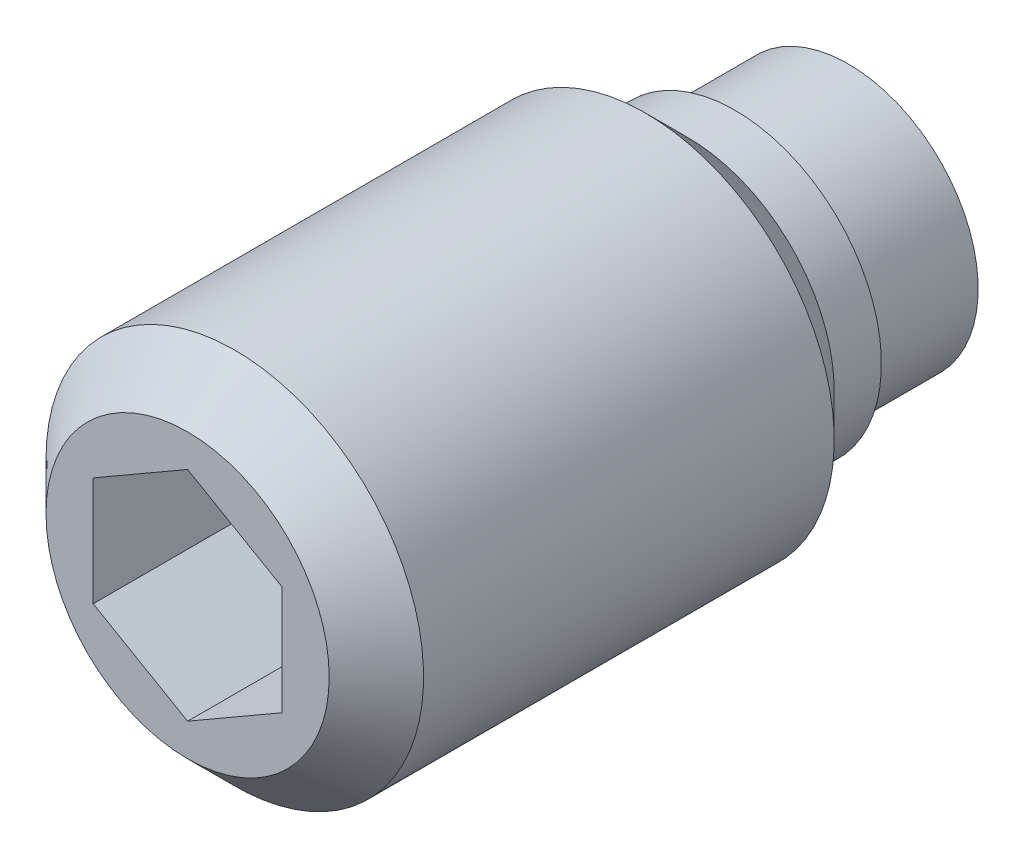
ISO-10303-21;
HEADER;
FILE_DESCRIPTION(('STEP AP214'),'2;1');
FILE_NAME('part.step','',(''),(''),'','','');
FILE_SCHEMA(('AUTOMOTIVE_DESIGN { 1 0 10303 214 1 1 1 1 }'));
ENDSEC;
DATA;
#1=APPLICATION_CONTEXT('core data for automotive mechanical design processes');
#2=APPLICATION_PROTOCOL_DEFINITION('international standard','automotive_design',2000,#1);
#3=PRODUCT_CONTEXT('',#1,'mechanical');
#4=PRODUCT('Part','Part','',(#3));
#5=PRODUCT_RELATED_PRODUCT_CATEGORY('part','',(#4));
#6=PRODUCT_DEFINITION_FORMATION('','',#4);
#7=PRODUCT_DEFINITION_CONTEXT('part definition',#1,'design');
#8=PRODUCT_DEFINITION('design','',#6,#7);
#9=PRODUCT_DEFINITION_SHAPE('','',#8);
#10=(LENGTH_UNIT() NAMED_UNIT(*) SI_UNIT(.MILLI.,.METRE.));
#11=(NAMED_UNIT(*) PLANE_ANGLE_UNIT() SI_UNIT($,.RADIAN.));
#12=(NAMED_UNIT(*) SI_UNIT($,.STERADIAN.) SOLID_ANGLE_UNIT());
#13=UNCERTAINTY_MEASURE_WITH_UNIT(LENGTH_MEASURE(1.E-05),#10,'distance_accuracy_value','');
#14=(GEOMETRIC_REPRESENTATION_CONTEXT(3) GLOBAL_UNCERTAINTY_ASSIGNED_CONTEXT((#13)) GLOBAL_UNIT_ASSIGNED_CONTEXT((#10,
#11,#12)) REPRESENTATION_CONTEXT('',''));
#15=CARTESIAN_POINT('',(0.,0.,0.));
#16=DIRECTION('',(0.,0.,1.));
#17=DIRECTION('',(1.,0.,0.));
#18=AXIS2_PLACEMENT_3D('',#15,#16,#17);
#19=CARTESIAN_POINT('',(0.,3.1,3.2));
#20=DIRECTION('',(0.,0.,1.));
#21=DIRECTION('',(1.,0.,0.));
#22=AXIS2_PLACEMENT_3D('',#19,#20,#21);
#23=PLANE('',#22);
#24=CARTESIAN_POINT('',(0.,0.,3.2));
#25=DIRECTION('',(0.,0.,-1.));
#26=DIRECTION('',(-1.,0.,0.));
#27=AXIS2_PLACEMENT_3D('',#24,#25,#26);
#28=CIRCLE('',#27,2.75);
#29=CARTESIAN_POINT('',(-2.75000000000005,0.,3.2));
#30=VERTEX_POINT('',#29);
#31=EDGE_CURVE('E103',#30,#30,#28,.T.);
#32=ORIENTED_EDGE('',*,*,#31,.F.);
#33=EDGE_LOOP('',(#32));
#34=FACE_BOUND('',#33,.T.);
#35=CARTESIAN_POINT('',(0.,0.,3.2));
#36=DIRECTION('',(0.,0.,-1.));
#37=DIRECTION('',(-1.,0.,0.));
#38=AXIS2_PLACEMENT_3D('',#35,#36,#37);
#39=CIRCLE('',#38,3.1);
#40=CARTESIAN_POINT('',(-3.10000000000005,0.,3.2));
#41=VERTEX_POINT('',#40);
#42=EDGE_CURVE('E123',#41,#41,#39,.T.);
#43=ORIENTED_EDGE('',*,*,#42,.T.);
#44=EDGE_LOOP('',(#43));
#45=FACE_BOUND('',#44,.T.);
#46=ADVANCED_FACE('F14',(#34,#45),#23,.F.);
#47=CARTESIAN_POINT('',(0.,0.,14.8));
#48=DIRECTION('',(0.,0.,-1.));
#49=DIRECTION('',(-1.,0.,0.));
#50=AXIS2_PLACEMENT_3D('',#47,#48,#49);
#51=PLANE('',#50);
#52=CARTESIAN_POINT('',(0.,0.,14.8));
#53=DIRECTION('',(0.,0.,-1.));
#54=DIRECTION('',(-1.,0.,0.));
#55=AXIS2_PLACEMENT_3D('',#52,#53,#54);
#56=CIRCLE('',#55,3.);
#57=CARTESIAN_POINT('',(-3.00000000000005,0.,14.8));
#58=VERTEX_POINT('',#57);
#59=EDGE_CURVE('E9',#58,#58,#56,.T.);
#60=ORIENTED_EDGE('',*,*,#59,.F.);
#61=EDGE_LOOP('',(#60));
#62=FACE_BOUND('',#61,.T.);
#63=DIRECTION('',(0.866025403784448,-0.499999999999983,0.));
#64=VECTOR('',#63,1.);
#65=CARTESIAN_POINT('',(0.,2.3094010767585,14.8));
#66=LINE('',#65,#64);
#67=CARTESIAN_POINT('',(0.,2.3094010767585,14.8));
#68=VERTEX_POINT('',#67);
#69=CARTESIAN_POINT('',(1.99999999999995,1.1547005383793,14.8));
#70=VERTEX_POINT('',#69);
#71=EDGE_CURVE('E29',#68,#70,#66,.T.);
#72=ORIENTED_EDGE('',*,*,#71,.T.);
#73=DIRECTION('',(0.,-1.,0.));
#74=VECTOR('',#73,1.);
#75=CARTESIAN_POINT('',(1.99999999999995,1.1547005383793,14.8));
#76=LINE('',#75,#74);
#77=CARTESIAN_POINT('',(1.99999999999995,-1.1547005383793,14.8));
#78=VERTEX_POINT('',#77);
#79=EDGE_CURVE('E102',#70,#78,#76,.T.);
#80=ORIENTED_EDGE('',*,*,#79,.T.);
#81=DIRECTION('',(-0.866025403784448,-0.499999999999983,0.));
#82=VECTOR('',#81,1.);
#83=CARTESIAN_POINT('',(1.99999999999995,-1.1547005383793,14.8));
#84=LINE('',#83,#82);
#85=CARTESIAN_POINT('',(0.,-2.3094010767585,14.8));
#86=VERTEX_POINT('',#85);
#87=EDGE_CURVE('E106',#78,#86,#84,.T.);
#88=ORIENTED_EDGE('',*,*,#87,.T.);
#89=DIRECTION('',(-0.866025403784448,0.499999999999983,0.));
#90=VECTOR('',#89,1.);
#91=CARTESIAN_POINT('',(0.,-2.3094010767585,14.8));
#92=LINE('',#91,#90);
#93=CARTESIAN_POINT('',(-2.00000000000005,-1.1547005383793,14.8));
#94=VERTEX_POINT('',#93);
#95=EDGE_CURVE('E109',#86,#94,#92,.T.);
#96=ORIENTED_EDGE('',*,*,#95,.T.);
#97=DIRECTION('',(0.,1.,0.));
#98=VECTOR('',#97,1.);
#99=CARTESIAN_POINT('',(-2.00000000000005,-1.1547005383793,14.8));
#100=LINE('',#99,#98);
#101=CARTESIAN_POINT('',(-2.00000000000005,1.1547005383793,14.8));
#102=VERTEX_POINT('',#101);
#103=EDGE_CURVE('E92',#94,#102,#100,.T.);
#104=ORIENTED_EDGE('',*,*,#103,.T.);
#105=DIRECTION('',(0.866025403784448,0.499999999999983,0.));
#106=VECTOR('',#105,1.);
#107=CARTESIAN_POINT('',(-2.00000000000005,1.1547005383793,14.8));
#108=LINE('',#107,#106);
#109=EDGE_CURVE('E112',#102,#68,#108,.T.);
#110=ORIENTED_EDGE('',*,*,#109,.T.);
#111=EDGE_LOOP('',(#72,#80,#88,#96,#104,#110));
#112=FACE_BOUND('',#111,.T.);
#113=ADVANCED_FACE('F16',(#62,#112),#51,.F.);
#114=CARTESIAN_POINT('',(0.,0.,14.8));
#115=DIRECTION('',(0.,0.,-1.));
#116=DIRECTION('',(-1.,0.,0.));
#117=AXIS2_PLACEMENT_3D('',#114,#115,#116);
#118=CONICAL_SURFACE('',#117,3.,0.785398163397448);
#119=CARTESIAN_POINT('',(0.,0.,13.8));
#120=DIRECTION('',(0.,0.,-1.));
#121=DIRECTION('',(-1.,0.,0.));
#122=AXIS2_PLACEMENT_3D('',#119,#120,#121);
#123=CIRCLE('',#122,4.);
#124=CARTESIAN_POINT('',(-4.00000000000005,0.,13.8));
#125=VERTEX_POINT('',#124);
#126=EDGE_CURVE('E22',#125,#125,#123,.T.);
#127=ORIENTED_EDGE('',*,*,#126,.F.);
#128=EDGE_LOOP('',(#127));
#129=FACE_BOUND('',#128,.T.);
#130=ORIENTED_EDGE('',*,*,#59,.T.);
#131=EDGE_LOOP('',(#130));
#132=FACE_BOUND('',#131,.T.);
#133=ADVANCED_FACE('F136',(#129,#132),#118,.T.);
#134=CARTESIAN_POINT('',(0.,0.,3.2));
#135=DIRECTION('',(0.,0.,-1.));
#136=DIRECTION('',(-1.,0.,0.));
#137=AXIS2_PLACEMENT_3D('',#134,#135,#136);
#138=CYLINDRICAL_SURFACE('',#137,4.);
#139=CARTESIAN_POINT('',(0.,0.,5.1));
#140=DIRECTION('',(0.,0.,-1.));
#141=DIRECTION('',(-1.,0.,0.));
#142=AXIS2_PLACEMENT_3D('',#139,#140,#141);
#143=CIRCLE('',#142,4.);
#144=CARTESIAN_POINT('',(-4.00000000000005,0.,5.1));
#145=VERTEX_POINT('',#144);
#146=EDGE_CURVE('E129',#145,#145,#143,.T.);
#147=ORIENTED_EDGE('',*,*,#146,.F.);
#148=EDGE_LOOP('',(#147));
#149=FACE_BOUND('',#148,.T.);
#150=ORIENTED_EDGE('',*,*,#126,.T.);
#151=EDGE_LOOP('',(#150));
#152=FACE_BOUND('',#151,.T.);
#153=ADVANCED_FACE('F134',(#149,#152),#138,.T.);
#154=CARTESIAN_POINT('',(0.,0.,5.1));
#155=DIRECTION('',(0.,0.,1.));
#156=DIRECTION('',(1.,0.,0.));
#157=AXIS2_PLACEMENT_3D('',#154,#155,#156);
#158=CONICAL_SURFACE('',#157,4.,0.785398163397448);
#159=CARTESIAN_POINT('',(0.,0.,4.2));
#160=DIRECTION('',(0.,0.,-1.));
#161=DIRECTION('',(-1.,0.,0.));
#162=AXIS2_PLACEMENT_3D('',#159,#160,#161);
#163=CIRCLE('',#162,3.1);
#164=CARTESIAN_POINT('',(-3.10000000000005,0.,4.2));
#165=VERTEX_POINT('',#164);
#166=EDGE_CURVE('E126',#165,#165,#163,.T.);
#167=ORIENTED_EDGE('',*,*,#166,.F.);
#168=EDGE_LOOP('',(#167));
#169=FACE_BOUND('',#168,.T.);
#170=ORIENTED_EDGE('',*,*,#146,.T.);
#171=EDGE_LOOP('',(#170));
#172=FACE_BOUND('',#171,.T.);
#173=ADVANCED_FACE('F178',(#169,#172),#158,.T.);
#174=CARTESIAN_POINT('',(0.,0.,3.2));
#175=DIRECTION('',(0.,0.,-1.));
#176=DIRECTION('',(-1.,0.,0.));
#177=AXIS2_PLACEMENT_3D('',#174,#175,#176);
#178=CYLINDRICAL_SURFACE('',#177,3.1);
#179=ORIENTED_EDGE('',*,*,#42,.F.);
#180=EDGE_LOOP('',(#179));
#181=FACE_BOUND('',#180,.T.);
#182=ORIENTED_EDGE('',*,*,#166,.T.);
#183=EDGE_LOOP('',(#182));
#184=FACE_BOUND('',#183,.T.);
#185=ADVANCED_FACE('F165',(#181,#184),#178,.T.);
#186=CARTESIAN_POINT('',(0.,2.3094010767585,10.8));
#187=DIRECTION('',(-0.499999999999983,-0.866025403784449,0.));
#188=DIRECTION('',(-0.866025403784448,0.499999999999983,0.));
#189=AXIS2_PLACEMENT_3D('',#186,#187,#188);
#190=PLANE('',#189);
#191=ORIENTED_EDGE('',*,*,#71,.F.);
#192=DIRECTION('',(0.,0.,1.));
#193=VECTOR('',#192,1.);
#194=CARTESIAN_POINT('',(0.,2.3094010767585,10.8));
#195=LINE('',#194,#193);
#196=CARTESIAN_POINT('',(0.,2.3094010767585,10.8));
#197=VERTEX_POINT('',#196);
#198=EDGE_CURVE('E97',#197,#68,#195,.T.);
#199=ORIENTED_EDGE('',*,*,#198,.F.);
#200=DIRECTION('',(0.866025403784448,-0.499999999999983,0.));
#201=VECTOR('',#200,1.);
#202=CARTESIAN_POINT('',(0.,2.3094010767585,10.8));
#203=LINE('',#202,#201);
#204=CARTESIAN_POINT('',(1.99999999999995,1.1547005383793,10.8));
#205=VERTEX_POINT('',#204);
#206=EDGE_CURVE('E115',#197,#205,#203,.T.);
#207=ORIENTED_EDGE('',*,*,#206,.T.);
#208=DIRECTION('',(0.,0.,1.));
#209=VECTOR('',#208,1.);
#210=CARTESIAN_POINT('',(1.99999999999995,1.1547005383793,10.8));
#211=LINE('',#210,#209);
#212=EDGE_CURVE('E121',#205,#70,#211,.T.);
#213=ORIENTED_EDGE('',*,*,#212,.T.);
#214=EDGE_LOOP('',(#191,#199,#207,#213));
#215=FACE_BOUND('',#214,.T.);
#216=ADVANCED_FACE('F144',(#215),#190,.T.);
#217=CARTESIAN_POINT('',(1.99999999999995,1.1547005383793,10.8));
#218=DIRECTION('',(-1.,0.,0.));
#219=DIRECTION('',(0.,0.,1.));
#220=AXIS2_PLACEMENT_3D('',#217,#218,#219);
#221=PLANE('',#220);
#222=ORIENTED_EDGE('',*,*,#79,.F.);
#223=ORIENTED_EDGE('',*,*,#212,.F.);
#224=DIRECTION('',(0.,-1.,0.));
#225=VECTOR('',#224,1.);
#226=CARTESIAN_POINT('',(1.99999999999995,1.1547005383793,10.8));
#227=LINE('',#226,#225);
#228=CARTESIAN_POINT('',(1.99999999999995,-1.1547005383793,10.8));
#229=VERTEX_POINT('',#228);
#230=EDGE_CURVE('E69',#205,#229,#227,.T.);
#231=ORIENTED_EDGE('',*,*,#230,.T.);
#232=DIRECTION('',(0.,0.,1.));
#233=VECTOR('',#232,1.);
#234=CARTESIAN_POINT('',(1.99999999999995,-1.1547005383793,10.8));
#235=LINE('',#234,#233);
#236=EDGE_CURVE('E119',#229,#78,#235,.T.);
#237=ORIENTED_EDGE('',*,*,#236,.T.);
#238=EDGE_LOOP('',(#222,#223,#231,#237));
#239=FACE_BOUND('',#238,.T.);
#240=ADVANCED_FACE('F155',(#239),#221,.T.);
#241=CARTESIAN_POINT('',(1.99999999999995,-1.1547005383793,10.8));
#242=DIRECTION('',(-0.499999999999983,0.866025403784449,0.));
#243=DIRECTION('',(0.866025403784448,0.499999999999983,0.));
#244=AXIS2_PLACEMENT_3D('',#241,#242,#243);
#245=PLANE('',#244);
#246=ORIENTED_EDGE('',*,*,#87,.F.);
#247=ORIENTED_EDGE('',*,*,#236,.F.);
#248=DIRECTION('',(-0.866025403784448,-0.499999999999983,0.));
#249=VECTOR('',#248,1.);
#250=CARTESIAN_POINT('',(1.99999999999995,-1.1547005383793,10.8));
#251=LINE('',#250,#249);
#252=CARTESIAN_POINT('',(0.,-2.3094010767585,10.8));
#253=VERTEX_POINT('',#252);
#254=EDGE_CURVE('E88',#229,#253,#251,.T.);
#255=ORIENTED_EDGE('',*,*,#254,.T.);
#256=DIRECTION('',(0.,0.,1.));
#257=VECTOR('',#256,1.);
#258=CARTESIAN_POINT('',(0.,-2.3094010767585,10.8));
#259=LINE('',#258,#257);
#260=EDGE_CURVE('E85',#253,#86,#259,.T.);
#261=ORIENTED_EDGE('',*,*,#260,.T.);
#262=EDGE_LOOP('',(#246,#247,#255,#261));
#263=FACE_BOUND('',#262,.T.);
#264=ADVANCED_FACE('F153',(#263),#245,.T.);
#265=CARTESIAN_POINT('',(0.,-2.3094010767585,10.8));
#266=DIRECTION('',(0.499999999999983,0.866025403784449,0.));
#267=DIRECTION('',(0.866025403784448,-0.499999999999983,0.));
#268=AXIS2_PLACEMENT_3D('',#265,#266,#267);
#269=PLANE('',#268);
#270=ORIENTED_EDGE('',*,*,#95,.F.);
#271=ORIENTED_EDGE('',*,*,#260,.F.);
#272=DIRECTION('',(-0.866025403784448,0.499999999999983,0.));
#273=VECTOR('',#272,1.);
#274=CARTESIAN_POINT('',(0.,-2.3094010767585,10.8));
#275=LINE('',#274,#273);
#276=CARTESIAN_POINT('',(-2.00000000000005,-1.1547005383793,10.8));
#277=VERTEX_POINT('',#276);
#278=EDGE_CURVE('E80',#253,#277,#275,.T.);
#279=ORIENTED_EDGE('',*,*,#278,.T.);
#280=DIRECTION('',(0.,0.,1.));
#281=VECTOR('',#280,1.);
#282=CARTESIAN_POINT('',(-2.00000000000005,-1.1547005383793,10.8));
#283=LINE('',#282,#281);
#284=EDGE_CURVE('E84',#277,#94,#283,.T.);
#285=ORIENTED_EDGE('',*,*,#284,.T.);
#286=EDGE_LOOP('',(#270,#271,#279,#285));
#287=FACE_BOUND('',#286,.T.);
#288=ADVANCED_FACE('F83',(#287),#269,.T.);
#289=CARTESIAN_POINT('',(-2.00000000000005,-1.1547005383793,10.8));
#290=DIRECTION('',(1.,0.,0.));
#291=DIRECTION('',(0.,0.,-1.));
#292=AXIS2_PLACEMENT_3D('',#289,#290,#291);
#293=PLANE('',#292);
#294=ORIENTED_EDGE('',*,*,#103,.F.);
#295=ORIENTED_EDGE('',*,*,#284,.F.);
#296=DIRECTION('',(0.,1.,0.));
#297=VECTOR('',#296,1.);
#298=CARTESIAN_POINT('',(-2.00000000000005,-1.1547005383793,10.8));
#299=LINE('',#298,#297);
#300=CARTESIAN_POINT('',(-2.00000000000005,1.1547005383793,10.8));
#301=VERTEX_POINT('',#300);
#302=EDGE_CURVE('E87',#277,#301,#299,.T.);
#303=ORIENTED_EDGE('',*,*,#302,.T.);
#304=DIRECTION('',(0.,0.,1.));
#305=VECTOR('',#304,1.);
#306=CARTESIAN_POINT('',(-2.00000000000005,1.1547005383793,10.8));
#307=LINE('',#306,#305);
#308=EDGE_CURVE('E60',#301,#102,#307,.T.);
#309=ORIENTED_EDGE('',*,*,#308,.T.);
#310=EDGE_LOOP('',(#294,#295,#303,#309));
#311=FACE_BOUND('',#310,.T.);
#312=ADVANCED_FACE('F90',(#311),#293,.T.);
#313=CARTESIAN_POINT('',(-2.00000000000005,1.1547005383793,10.8));
#314=DIRECTION('',(0.499999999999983,-0.866025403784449,0.));
#315=DIRECTION('',(-0.866025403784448,-0.499999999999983,0.));
#316=AXIS2_PLACEMENT_3D('',#313,#314,#315);
#317=PLANE('',#316);
#318=ORIENTED_EDGE('',*,*,#109,.F.);
#319=ORIENTED_EDGE('',*,*,#308,.F.);
#320=DIRECTION('',(0.866025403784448,0.499999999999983,0.));
#321=VECTOR('',#320,1.);
#322=CARTESIAN_POINT('',(-2.00000000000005,1.1547005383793,10.8));
#323=LINE('',#322,#321);
#324=EDGE_CURVE('E37',#301,#197,#323,.T.);
#325=ORIENTED_EDGE('',*,*,#324,.T.);
#326=ORIENTED_EDGE('',*,*,#198,.T.);
#327=EDGE_LOOP('',(#318,#319,#325,#326));
#328=FACE_BOUND('',#327,.T.);
#329=ADVANCED_FACE('F143',(#328),#317,.T.);
#330=CARTESIAN_POINT('',(0.,0.,10.8));
#331=DIRECTION('',(0.,0.,-1.));
#332=DIRECTION('',(-1.,0.,0.));
#333=AXIS2_PLACEMENT_3D('',#330,#331,#332);
#334=PLANE('',#333);
#335=ORIENTED_EDGE('',*,*,#206,.F.);
#336=ORIENTED_EDGE('',*,*,#324,.F.);
#337=ORIENTED_EDGE('',*,*,#302,.F.);
#338=ORIENTED_EDGE('',*,*,#278,.F.);
#339=ORIENTED_EDGE('',*,*,#254,.F.);
#340=ORIENTED_EDGE('',*,*,#230,.F.);
#341=EDGE_LOOP('',(#335,#336,#337,#338,#339,#340));
#342=FACE_BOUND('',#341,.T.);
#343=ADVANCED_FACE('F95',(#342),#334,.F.);
#344=CARTESIAN_POINT('',(0.,0.,0.));
#345=DIRECTION('',(0.,0.,-1.));
#346=DIRECTION('',(-1.,0.,0.));
#347=AXIS2_PLACEMENT_3D('',#344,#345,#346);
#348=CYLINDRICAL_SURFACE('',#347,2.75);
#349=CARTESIAN_POINT('',(0.,0.,0.8));
#350=DIRECTION('',(0.,0.,-1.));
#351=DIRECTION('',(-1.,0.,0.));
#352=AXIS2_PLACEMENT_3D('',#349,#350,#351);
#353=CIRCLE('',#352,2.75);
#354=CARTESIAN_POINT('',(-2.75000000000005,0.,0.8));
#355=VERTEX_POINT('',#354);
#356=EDGE_CURVE('E297',#355,#355,#353,.T.);
#357=ORIENTED_EDGE('',*,*,#356,.F.);
#358=EDGE_LOOP('',(#357));
#359=FACE_BOUND('',#358,.T.);
#360=ORIENTED_EDGE('',*,*,#31,.T.);
#361=EDGE_LOOP('',(#360));
#362=FACE_BOUND('',#361,.T.);
#363=ADVANCED_FACE('F263',(#359,#362),#348,.T.);
#364=CARTESIAN_POINT('',(-0.0368577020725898,0.,4.99986414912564));
#365=DIRECTION('',(0.,-1.,0.));
#366=DIRECTION('',(-1.,0.,0.));
#367=AXIS2_PLACEMENT_3D('',#364,#365,#366);
#368=CIRCLE('',#367,4.99999999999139);
#369=TRIMMED_CURVE('',#368,(PARAMETER_VALUE(-1.57816793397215)),
(PARAMETER_VALUE(1.57816793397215)),.T.,.PARAMETER.);
#370=CARTESIAN_POINT('',(0.,0.,4.99986414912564));
#371=DIRECTION('',(0.,0.,-1.));
#372=AXIS1_PLACEMENT('',#370,#371);
#373=SURFACE_OF_REVOLUTION('',#369,#372);
#374=ORIENTED_EDGE('',*,*,#356,.T.);
#375=EDGE_LOOP('',(#374));
#376=FACE_BOUND('',#375,.T.);
#377=CARTESIAN_POINT('',(0.,0.,0.));
#378=VERTEX_POINT('',#377);
#379=VERTEX_LOOP('',#378);
#380=FACE_BOUND('',#379,.T.);
#381=ADVANCED_FACE('F270',(#376,#380),#373,.T.);
#382=CLOSED_SHELL('',(#46,#113,#133,#153,#173,#185,#216,#240,#264,#288,#312,#329,#343,#363,#381));
#383=MANIFOLD_SOLID_BREP('B1',#382);
#384=ADVANCED_BREP_SHAPE_REPRESENTATION('',(#18,#383),#14);
#385=SHAPE_DEFINITION_REPRESENTATION(#9,#384);
ENDSEC;
END-ISO-10303-21;
